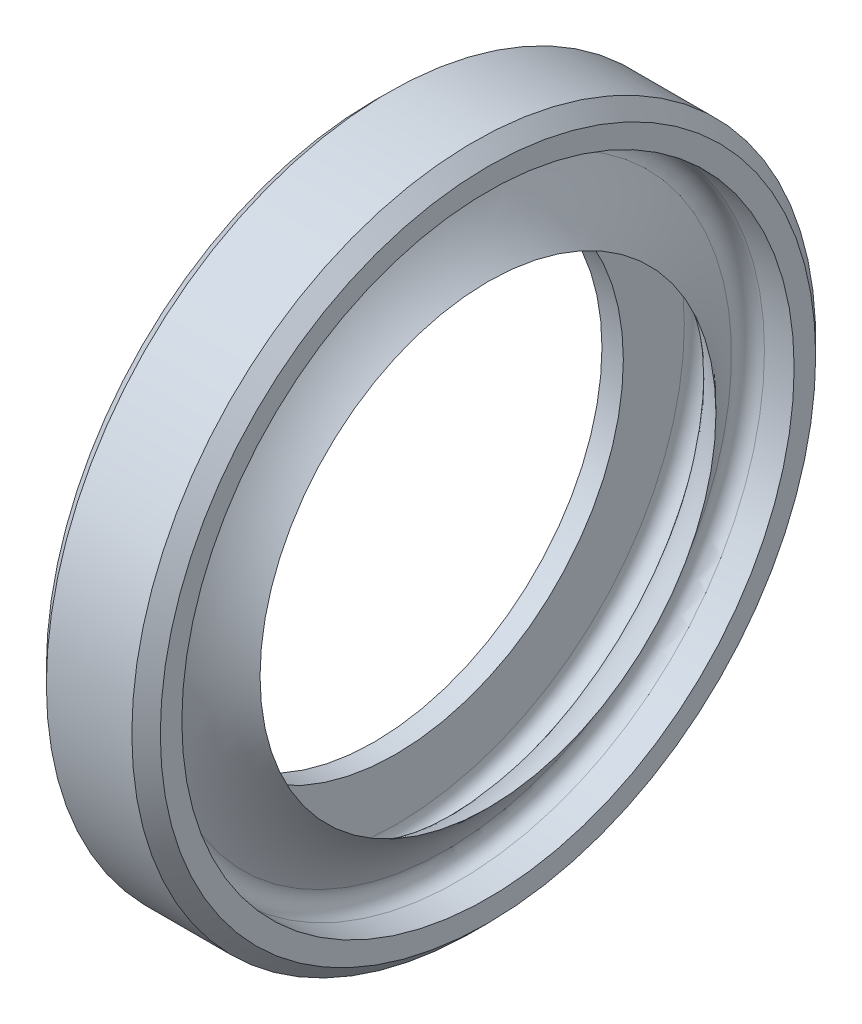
from build123d import *


with BuildPart() as part:
    # Esquisse2 → R_volution1 (revolve)
    with BuildSketch(Plane.XY, mode=Mode.PRIVATE) as r_volution1_sk:
        with BuildLine():
            Line((-5.119383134, 16), (-5.119383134, 23))
            Line((-5.119383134, 23), (-4.119383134, 24))
            Line((-4.119383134, 24), (1.880616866, 24))
            Line((1.880616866, 24), (2.880616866, 23))
            Line((2.880616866, 23), (2.880616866, 21.489974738))
            Line((2.880616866, 21.489974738), (0.796577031, 21.489974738))
            ThreePointArc((0.796577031, 21.489974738), (-0.03904332, 21.039282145), (-0.121447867, 20.093451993))
            ThreePointArc((-0.121447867, 20.093451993), (1.148294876, 17.877102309), (2.880616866, 16))
            ThreePointArc((2.880616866, 16), (0.075925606, 17.946650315), (-1.763498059, 20.822804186))
            ThreePointArc((-1.763498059, 20.822804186), (-2.893972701, 21.243609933), (-3.619383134, 20.279851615))
            Line((-3.619383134, 20.279851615), (-3.619383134, 16))
            Line((-3.619383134, 16), (-5.119383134, 16))
        make_face()
    revolve(r_volution1_sk.sketch.rotate(Axis((-28.173405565, 0, 0), (1, 0, 0)), 90), axis=Axis((-28.173405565, 0, 0), (1, 0, 0)))


solid = part.part
